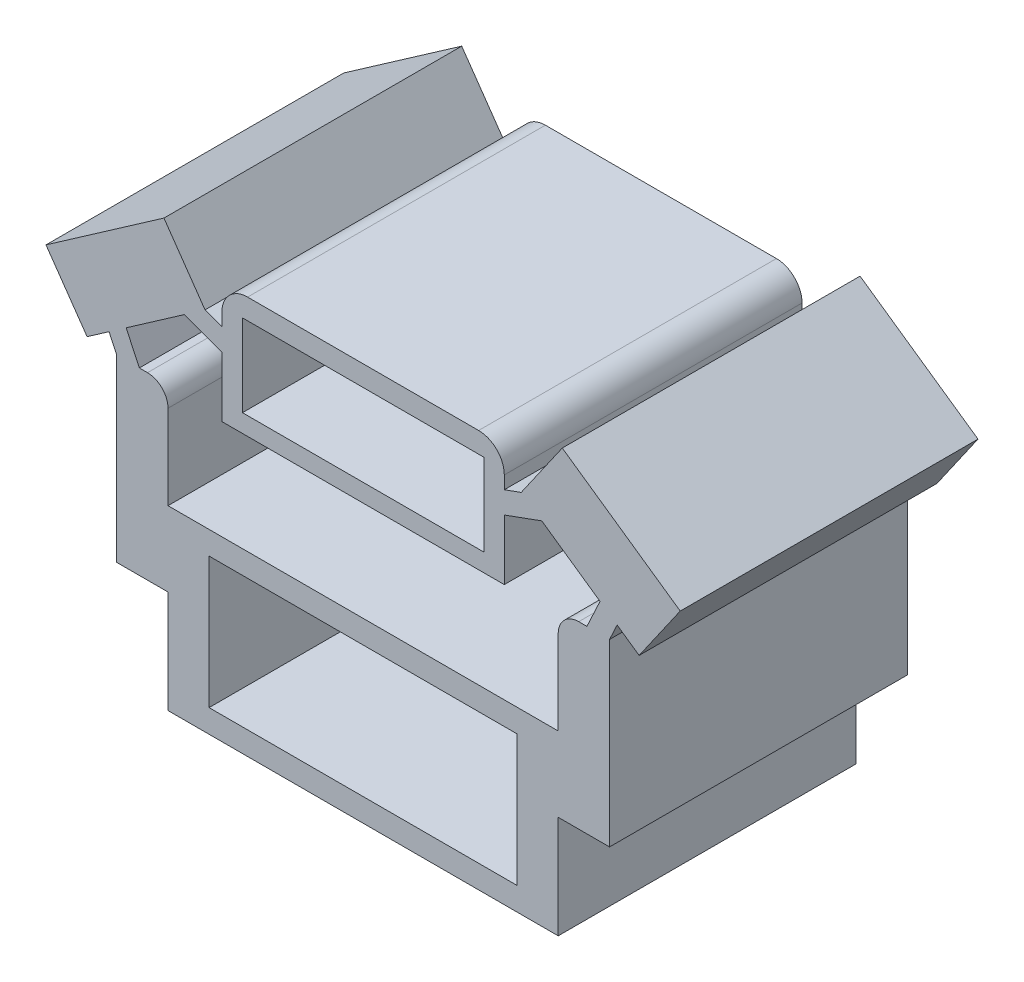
from build123d import *

# Parameters (mm, degrees)
EXTRUDE_1_DEPTH     = 5.8
SKETCH_10_W         = 6
SKETCH_10_H         = 2.1
SKETCH_10_W_2       = 4.7
SKETCH_10_H_2       = 1.6
CUT_EXTRUDE_3_DEPTH = 11.599293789
EXTRUDE_2_DEPTH     = 5.8
FILLET_1_R          = 0.5
SKETCH_12_W         = 6
SKETCH_12_H         = 0.1
SKETCH_12_W_2       = 7.6
SKETCH_12_H_2       = 0.5
EXTRUDE_3_DEPTH     = 5.8
SKETCH_14_W         = 6
SKETCH_14_H         = 0.4
CUT_EXTRUDE_4_DEPTH = 11.599293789
FILLET_2_R          = 0.4
SCALE_1_SCALE       = 0.192
SKETCH_19_W         = 1.4592
SKETCH_19_H         = 0.03
EXTRUDE_5_DEPTH     = 1.1136
SKETCH_20_W         = 1.152
SKETCH_20_H         = 0.03
CUT_EXTRUDE_5_DEPTH = 4.599836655


with BuildPart() as part:
    # Sketch 1 → Extrude 1 (new body)
    with BuildSketch(Plane.XY):
        Polygon((2.75, 5.1), (3.078892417, 5.21970705), (3.879338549, 6.368308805), (6.176542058, 4.767416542), (5.376095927, 3.618814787), (4.947916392, 3.917207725), (4.8, 3.6), (4.8, 0.1), (3.8, 0.1), (3.8, -1.4), (-3.8, -1.4), (-3.8, 1.4), (3.8, 1.4), (3.8, 3.6), (4.358648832, 3.6), (4.614812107, 4.149343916), (3.480144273, 4.940079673), (2.75, 4.674328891), (2.75, 3.5), (-2.75, 3.5), (-2.75, 5.1), align=None)
    extrude_1 = extrude(amount=EXTRUDE_1_DEPTH)

    # Mirror 1: Extrude 1 across plane
    add(extrude_1.mirror(Plane(origin=(0, 0, 0), x_dir=(0, 0, 1), z_dir=(1, 0, 0))))

    # Sketch 10 → Cut-Extrude 3 (cut, through all)
    with BuildSketch(Plane.XY.offset(5.8)):
        Rectangle(SKETCH_10_W, SKETCH_10_H)
        with Locations((0, 4.65)):
            Rectangle(SKETCH_10_W_2, SKETCH_10_H_2)
    extrude(amount=-CUT_EXTRUDE_3_DEPTH, mode=Mode.SUBTRACT)

    # Sketch 11 → Extrude 2 (add)
    with BuildSketch(Plane.XY.offset(5.8)):
        Polygon((-2.35, 5.1), (-2.75, 5.1), (-2.75, 5.85), (2.75, 5.85), (2.75, 5.1), (2.35, 5.1), (2.35, 5.45), (-2.35, 5.45), align=None)
    extrude(amount=-EXTRUDE_2_DEPTH)

    # Fillet 1
    fillet_1_edges = [part.edges().sort_by_distance(p)[0] for p in [
        (2.75, 5.85, 2.9),
        (-2.75, 5.85, 2.9),
    ]]
    fillet(fillet_1_edges, radius=FILLET_1_R)

    # Sketch 12 → Extrude 3 (add)
    with BuildSketch(Plane.XY.offset(5.8)):
        with Locations((0, 1)):
            Rectangle(SKETCH_12_W, SKETCH_12_H)
        with Locations((0, -1.65)):
            Rectangle(SKETCH_12_W_2, SKETCH_12_H_2)
    extrude(amount=-EXTRUDE_3_DEPTH)

    # Sketch 14 → Cut-Extrude 4 (cut, through all)
    with BuildSketch(Plane.XY.offset(5.8)):
        with Locations((0, -1.25)):
            Rectangle(SKETCH_14_W, SKETCH_14_H)
    extrude(amount=-CUT_EXTRUDE_4_DEPTH, mode=Mode.SUBTRACT)

    # Fillet 2
    fillet_2_edges = [part.edges().sort_by_distance(p)[0] for p in [
        (3.8, 3.6, 2.9),
        (-3.8, 3.6, 2.9),
    ]]
    fillet(fillet_2_edges, radius=FILLET_2_R)


with BuildPart() as part_1:
    # Scale 1: scaled about (0, 2.46110462, 2.9)
    add(part.part.scale(SCALE_1_SCALE).moved(Location((0, 1.988572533, 2.3432))))

    # Sketch 19 → Extrude 5 (add)
    with BuildSketch(Plane.XY.offset(3.4568)):
        with Locations((0, 2.272372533)):
            Rectangle(SKETCH_19_W, SKETCH_19_H)
    extrude(amount=-EXTRUDE_5_DEPTH)

    # Sketch 20 → Cut-Extrude 5 (cut, through all)
    with BuildSketch(Plane.XY.offset(3.4568)):
        with Locations((0, 2.185972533)):
            Rectangle(SKETCH_20_W, SKETCH_20_H)
    extrude(amount=-CUT_EXTRUDE_5_DEPTH, mode=Mode.SUBTRACT)


solid = part_1.part
